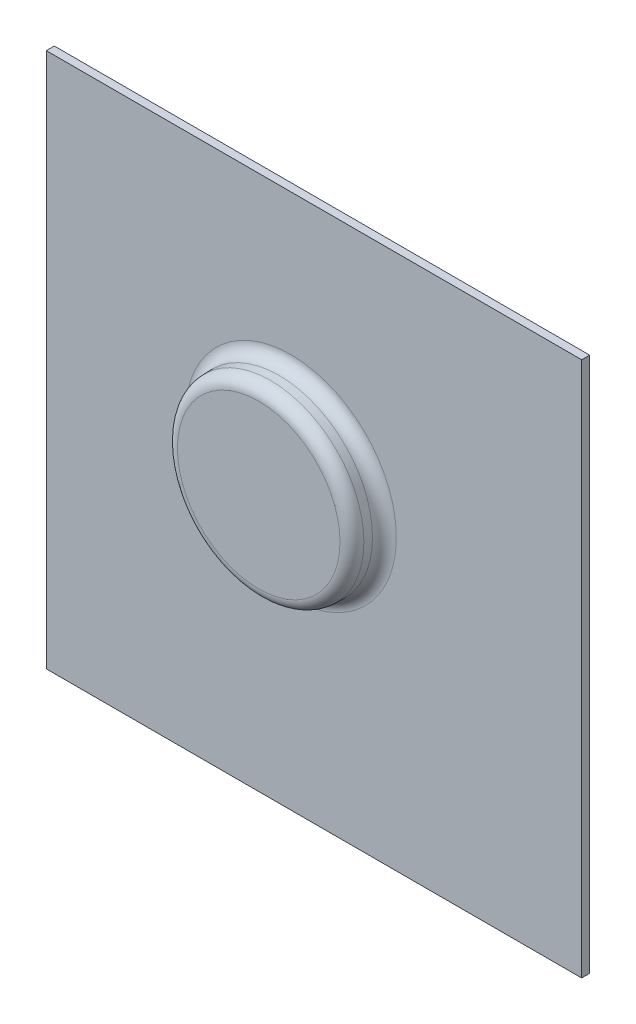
ISO-10303-21;
HEADER;
FILE_DESCRIPTION(('STEP AP214'),'2;1');
FILE_NAME('part.step','',(''),(''),'','','');
FILE_SCHEMA(('AUTOMOTIVE_DESIGN { 1 0 10303 214 1 1 1 1 }'));
ENDSEC;
DATA;
#1=APPLICATION_CONTEXT('core data for automotive mechanical design processes');
#2=APPLICATION_PROTOCOL_DEFINITION('international standard','automotive_design',2000,#1);
#3=PRODUCT_CONTEXT('',#1,'mechanical');
#4=PRODUCT('Part','Part','',(#3));
#5=PRODUCT_RELATED_PRODUCT_CATEGORY('part','',(#4));
#6=PRODUCT_DEFINITION_FORMATION('','',#4);
#7=PRODUCT_DEFINITION_CONTEXT('part definition',#1,'design');
#8=PRODUCT_DEFINITION('design','',#6,#7);
#9=PRODUCT_DEFINITION_SHAPE('','',#8);
#10=(LENGTH_UNIT() NAMED_UNIT(*) SI_UNIT(.MILLI.,.METRE.));
#11=(NAMED_UNIT(*) PLANE_ANGLE_UNIT() SI_UNIT($,.RADIAN.));
#12=(NAMED_UNIT(*) SI_UNIT($,.STERADIAN.) SOLID_ANGLE_UNIT());
#13=UNCERTAINTY_MEASURE_WITH_UNIT(LENGTH_MEASURE(1.E-05),#10,'distance_accuracy_value','');
#14=(GEOMETRIC_REPRESENTATION_CONTEXT(3) GLOBAL_UNCERTAINTY_ASSIGNED_CONTEXT((#13)) GLOBAL_UNIT_ASSIGNED_CONTEXT((#10,
#11,#12)) REPRESENTATION_CONTEXT('',''));
#15=CARTESIAN_POINT('',(0.,0.,0.));
#16=DIRECTION('',(0.,0.,1.));
#17=DIRECTION('',(1.,0.,0.));
#18=AXIS2_PLACEMENT_3D('',#15,#16,#17);
#19=CARTESIAN_POINT('',(0.,100.,0.));
#20=DIRECTION('',(0.,0.,-1.));
#21=DIRECTION('',(-1.,0.,0.));
#22=AXIS2_PLACEMENT_3D('',#19,#20,#21);
#23=PLANE('',#22);
#24=DIRECTION('',(0.,-1.,0.));
#25=VECTOR('',#24,1.);
#26=CARTESIAN_POINT('',(0.,0.,0.));
#27=LINE('',#26,#25);
#28=CARTESIAN_POINT('',(0.,100.,0.));
#29=VERTEX_POINT('',#28);
#30=CARTESIAN_POINT('',(0.,0.,0.));
#31=VERTEX_POINT('',#30);
#32=EDGE_CURVE('E162',#29,#31,#27,.T.);
#33=ORIENTED_EDGE('',*,*,#32,.F.);
#34=DIRECTION('',(-1.,0.,0.));
#35=VECTOR('',#34,1.);
#36=CARTESIAN_POINT('',(0.,100.,0.));
#37=LINE('',#36,#35);
#38=CARTESIAN_POINT('',(100.,100.,0.));
#39=VERTEX_POINT('',#38);
#40=EDGE_CURVE('E78',#39,#29,#37,.T.);
#41=ORIENTED_EDGE('',*,*,#40,.F.);
#42=DIRECTION('',(0.,1.,0.));
#43=VECTOR('',#42,1.);
#44=CARTESIAN_POINT('',(100.,0.,0.));
#45=LINE('',#44,#43);
#46=CARTESIAN_POINT('',(100.,0.,0.));
#47=VERTEX_POINT('',#46);
#48=EDGE_CURVE('E167',#47,#39,#45,.T.);
#49=ORIENTED_EDGE('',*,*,#48,.F.);
#50=DIRECTION('',(1.,0.,0.));
#51=VECTOR('',#50,1.);
#52=CARTESIAN_POINT('',(0.,0.,0.));
#53=LINE('',#52,#51);
#54=EDGE_CURVE('E165',#31,#47,#53,.T.);
#55=ORIENTED_EDGE('',*,*,#54,.F.);
#56=EDGE_LOOP('',(#33,#41,#49,#55));
#57=FACE_BOUND('',#56,.T.);
#58=DIRECTION('',(-1.,0.,0.));
#59=VECTOR('',#58,1.);
#60=CARTESIAN_POINT('',(0.,99.,0.));
#61=LINE('',#60,#59);
#62=CARTESIAN_POINT('',(99.,99.,0.));
#63=VERTEX_POINT('',#62);
#64=CARTESIAN_POINT('',(1.,99.,0.));
#65=VERTEX_POINT('',#64);
#66=EDGE_CURVE('E150',#63,#65,#61,.T.);
#67=ORIENTED_EDGE('',*,*,#66,.T.);
#68=DIRECTION('',(0.,-1.,0.));
#69=VECTOR('',#68,1.);
#70=CARTESIAN_POINT('',(1.,100.,0.));
#71=LINE('',#70,#69);
#72=CARTESIAN_POINT('',(1.,1.,0.));
#73=VERTEX_POINT('',#72);
#74=EDGE_CURVE('E146',#65,#73,#71,.T.);
#75=ORIENTED_EDGE('',*,*,#74,.T.);
#76=DIRECTION('',(1.,0.,0.));
#77=VECTOR('',#76,1.);
#78=CARTESIAN_POINT('',(0.,1.,0.));
#79=LINE('',#78,#77);
#80=CARTESIAN_POINT('',(99.,1.,0.));
#81=VERTEX_POINT('',#80);
#82=EDGE_CURVE('E149',#73,#81,#79,.T.);
#83=ORIENTED_EDGE('',*,*,#82,.T.);
#84=DIRECTION('',(0.,1.,0.));
#85=VECTOR('',#84,1.);
#86=CARTESIAN_POINT('',(99.,100.,0.));
#87=LINE('',#86,#85);
#88=EDGE_CURVE('E48',#81,#63,#87,.T.);
#89=ORIENTED_EDGE('',*,*,#88,.T.);
#90=EDGE_LOOP('',(#67,#75,#83,#89));
#91=FACE_BOUND('',#90,.T.);
#92=ADVANCED_FACE('F33',(#57,#91),#23,.T.);
#93=CARTESIAN_POINT('',(0.,100.,1.5));
#94=DIRECTION('',(0.,0.,-1.));
#95=DIRECTION('',(-1.,0.,0.));
#96=AXIS2_PLACEMENT_3D('',#93,#94,#95);
#97=PLANE('',#96);
#98=CARTESIAN_POINT('',(45.6754604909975,53.96195551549,1.5));
#99=DIRECTION('',(0.,0.,-1.));
#100=DIRECTION('',(-1.,0.,0.));
#101=AXIS2_PLACEMENT_3D('',#98,#99,#100);
#102=CIRCLE('',#101,19.7110688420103);
#103=CARTESIAN_POINT('',(25.9643916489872,53.96195551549,1.5));
#104=VERTEX_POINT('',#103);
#105=EDGE_CURVE('E11',#104,#104,#102,.T.);
#106=ORIENTED_EDGE('',*,*,#105,.T.);
#107=EDGE_LOOP('',(#106));
#108=FACE_BOUND('',#107,.T.);
#109=DIRECTION('',(0.,-1.,0.));
#110=VECTOR('',#109,1.);
#111=CARTESIAN_POINT('',(0.,0.,1.5));
#112=LINE('',#111,#110);
#113=CARTESIAN_POINT('',(0.,100.,1.5));
#114=VERTEX_POINT('',#113);
#115=CARTESIAN_POINT('',(0.,0.,1.5));
#116=VERTEX_POINT('',#115);
#117=EDGE_CURVE('E155',#114,#116,#112,.T.);
#118=ORIENTED_EDGE('',*,*,#117,.T.);
#119=DIRECTION('',(1.,0.,0.));
#120=VECTOR('',#119,1.);
#121=CARTESIAN_POINT('',(0.,0.,1.5));
#122=LINE('',#121,#120);
#123=CARTESIAN_POINT('',(100.,0.,1.5));
#124=VERTEX_POINT('',#123);
#125=EDGE_CURVE('E86',#116,#124,#122,.T.);
#126=ORIENTED_EDGE('',*,*,#125,.T.);
#127=DIRECTION('',(0.,1.,0.));
#128=VECTOR('',#127,1.);
#129=CARTESIAN_POINT('',(100.,0.,1.5));
#130=LINE('',#129,#128);
#131=CARTESIAN_POINT('',(100.,100.,1.5));
#132=VERTEX_POINT('',#131);
#133=EDGE_CURVE('E158',#124,#132,#130,.T.);
#134=ORIENTED_EDGE('',*,*,#133,.T.);
#135=DIRECTION('',(-1.,0.,0.));
#136=VECTOR('',#135,1.);
#137=CARTESIAN_POINT('',(0.,100.,1.5));
#138=LINE('',#137,#136);
#139=EDGE_CURVE('E57',#132,#114,#138,.T.);
#140=ORIENTED_EDGE('',*,*,#139,.T.);
#141=EDGE_LOOP('',(#118,#126,#134,#140));
#142=FACE_BOUND('',#141,.T.);
#143=ADVANCED_FACE('F203',(#108,#142),#97,.F.);
#144=CARTESIAN_POINT('',(0.,0.,1.5));
#145=DIRECTION('',(1.,0.,0.));
#146=DIRECTION('',(0.,0.,-1.));
#147=AXIS2_PLACEMENT_3D('',#144,#145,#146);
#148=PLANE('',#147);
#149=ORIENTED_EDGE('',*,*,#32,.T.);
#150=DIRECTION('',(0.,0.,-1.));
#151=VECTOR('',#150,1.);
#152=CARTESIAN_POINT('',(0.,0.,1.5));
#153=LINE('',#152,#151);
#154=EDGE_CURVE('E176',#116,#31,#153,.T.);
#155=ORIENTED_EDGE('',*,*,#154,.F.);
#156=ORIENTED_EDGE('',*,*,#117,.F.);
#157=DIRECTION('',(0.,0.,-1.));
#158=VECTOR('',#157,1.);
#159=CARTESIAN_POINT('',(0.,100.,1.5));
#160=LINE('',#159,#158);
#161=EDGE_CURVE('E161',#114,#29,#160,.T.);
#162=ORIENTED_EDGE('',*,*,#161,.T.);
#163=EDGE_LOOP('',(#149,#155,#156,#162));
#164=FACE_BOUND('',#163,.T.);
#165=ADVANCED_FACE('F209',(#164),#148,.F.);
#166=CARTESIAN_POINT('',(0.,0.,1.5));
#167=DIRECTION('',(0.,1.,0.));
#168=DIRECTION('',(0.,0.,1.));
#169=AXIS2_PLACEMENT_3D('',#166,#167,#168);
#170=PLANE('',#169);
#171=ORIENTED_EDGE('',*,*,#54,.T.);
#172=DIRECTION('',(0.,0.,-1.));
#173=VECTOR('',#172,1.);
#174=CARTESIAN_POINT('',(100.,0.,1.5));
#175=LINE('',#174,#173);
#176=EDGE_CURVE('E173',#124,#47,#175,.T.);
#177=ORIENTED_EDGE('',*,*,#176,.F.);
#178=ORIENTED_EDGE('',*,*,#125,.F.);
#179=ORIENTED_EDGE('',*,*,#154,.T.);
#180=EDGE_LOOP('',(#171,#177,#178,#179));
#181=FACE_BOUND('',#180,.T.);
#182=ADVANCED_FACE('F222',(#181),#170,.F.);
#183=CARTESIAN_POINT('',(100.,0.,1.5));
#184=DIRECTION('',(-1.,0.,0.));
#185=DIRECTION('',(0.,0.,1.));
#186=AXIS2_PLACEMENT_3D('',#183,#184,#185);
#187=PLANE('',#186);
#188=ORIENTED_EDGE('',*,*,#48,.T.);
#189=DIRECTION('',(0.,0.,-1.));
#190=VECTOR('',#189,1.);
#191=CARTESIAN_POINT('',(100.,100.,1.5));
#192=LINE('',#191,#190);
#193=EDGE_CURVE('E171',#132,#39,#192,.T.);
#194=ORIENTED_EDGE('',*,*,#193,.F.);
#195=ORIENTED_EDGE('',*,*,#133,.F.);
#196=ORIENTED_EDGE('',*,*,#176,.T.);
#197=EDGE_LOOP('',(#188,#194,#195,#196));
#198=FACE_BOUND('',#197,.T.);
#199=ADVANCED_FACE('F219',(#198),#187,.F.);
#200=CARTESIAN_POINT('',(0.,100.,1.5));
#201=DIRECTION('',(0.,-1.,0.));
#202=DIRECTION('',(0.,0.,-1.));
#203=AXIS2_PLACEMENT_3D('',#200,#201,#202);
#204=PLANE('',#203);
#205=ORIENTED_EDGE('',*,*,#40,.T.);
#206=ORIENTED_EDGE('',*,*,#161,.F.);
#207=ORIENTED_EDGE('',*,*,#139,.F.);
#208=ORIENTED_EDGE('',*,*,#193,.T.);
#209=EDGE_LOOP('',(#205,#206,#207,#208));
#210=FACE_BOUND('',#209,.T.);
#211=ADVANCED_FACE('F216',(#210),#204,.F.);
#212=CARTESIAN_POINT('',(45.6754604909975,53.96195551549,1.5));
#213=DIRECTION('',(0.,0.,-1.));
#214=DIRECTION('',(1.,0.,0.));
#215=AXIS2_PLACEMENT_3D('',#212,#213,#214);
#216=CONICAL_SURFACE('',#215,17.5,0.0174532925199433);
#217=CARTESIAN_POINT('',(45.6754604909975,53.96195551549,3.71073208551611));
#218=DIRECTION('',(0.,0.,-1.));
#219=DIRECTION('',(-1.,0.,0.));
#220=AXIS2_PLACEMENT_3D('',#217,#218,#219);
#221=CIRCLE('',#220,17.4614115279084);
#222=CARTESIAN_POINT('',(28.214048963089,53.96195551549,3.71073208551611));
#223=VERTEX_POINT('',#222);
#224=EDGE_CURVE('E41',#223,#223,#221,.F.);
#225=ORIENTED_EDGE('',*,*,#224,.T.);
#226=EDGE_LOOP('',(#225));
#227=FACE_BOUND('',#226,.T.);
#228=CARTESIAN_POINT('',(45.6754604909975,53.96195551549,5.28926791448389));
#229=DIRECTION('',(0.,0.,-1.));
#230=DIRECTION('',(-1.,0.,0.));
#231=AXIS2_PLACEMENT_3D('',#228,#229,#230);
#232=CIRCLE('',#231,17.4338580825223);
#233=CARTESIAN_POINT('',(28.2416024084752,53.96195551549,5.28926791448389));
#234=VERTEX_POINT('',#233);
#235=EDGE_CURVE('E181',#234,#234,#232,.T.);
#236=ORIENTED_EDGE('',*,*,#235,.T.);
#237=EDGE_LOOP('',(#236));
#238=FACE_BOUND('',#237,.T.);
#239=ADVANCED_FACE('F186',(#227,#238),#216,.T.);
#240=CARTESIAN_POINT('',(45.6754604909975,53.96195551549,7.5));
#241=DIRECTION('',(0.,0.,1.));
#242=DIRECTION('',(1.,0.,0.));
#243=AXIS2_PLACEMENT_3D('',#240,#241,#242);
#244=PLANE('',#243);
#245=CARTESIAN_POINT('',(45.6754604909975,53.96195551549,7.5));
#246=DIRECTION('',(0.,0.,1.));
#247=DIRECTION('',(1.,0.,0.));
#248=AXIS2_PLACEMENT_3D('',#245,#246,#247);
#249=CIRCLE('',#248,15.1842007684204);
#250=CARTESIAN_POINT('',(60.8596612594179,53.96195551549,7.5));
#251=VERTEX_POINT('',#250);
#252=EDGE_CURVE('E178',#251,#251,#249,.T.);
#253=ORIENTED_EDGE('',*,*,#252,.T.);
#254=EDGE_LOOP('',(#253));
#255=FACE_BOUND('',#254,.T.);
#256=ADVANCED_FACE('F199',(#255),#244,.T.);
#257=CARTESIAN_POINT('',(45.6754604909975,53.96195551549,5.25));
#258=DIRECTION('',(0.,0.,1.));
#259=DIRECTION('',(1.,0.,0.));
#260=AXIS2_PLACEMENT_3D('',#257,#258,#259);
#261=TOROIDAL_SURFACE('',#260,15.1842007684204,2.25);
#262=ORIENTED_EDGE('',*,*,#235,.F.);
#263=EDGE_LOOP('',(#262));
#264=FACE_BOUND('',#263,.T.);
#265=ORIENTED_EDGE('',*,*,#252,.F.);
#266=EDGE_LOOP('',(#265));
#267=FACE_BOUND('',#266,.T.);
#268=ADVANCED_FACE('F190',(#264,#267),#261,.T.);
#269=CARTESIAN_POINT('',(45.6754604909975,53.96195551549,3.75));
#270=DIRECTION('',(0.,0.,-1.));
#271=DIRECTION('',(-1.,0.,0.));
#272=AXIS2_PLACEMENT_3D('',#269,#270,#271);
#273=TOROIDAL_SURFACE('',#272,19.7110688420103,2.25);
#274=ORIENTED_EDGE('',*,*,#105,.F.);
#275=EDGE_LOOP('',(#274));
#276=FACE_BOUND('',#275,.T.);
#277=ORIENTED_EDGE('',*,*,#224,.F.);
#278=EDGE_LOOP('',(#277));
#279=FACE_BOUND('',#278,.T.);
#280=ADVANCED_FACE('F35',(#276,#279),#273,.F.);
#281=CARTESIAN_POINT('',(0.,100.,0.5));
#282=DIRECTION('',(0.,0.,-1.));
#283=DIRECTION('',(-1.,0.,0.));
#284=AXIS2_PLACEMENT_3D('',#281,#282,#283);
#285=PLANE('',#284);
#286=CARTESIAN_POINT('',(45.6754604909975,53.96195551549,0.5));
#287=DIRECTION('',(0.,0.,-1.));
#288=DIRECTION('',(-1.,0.,0.));
#289=AXIS2_PLACEMENT_3D('',#286,#287,#288);
#290=CIRCLE('',#289,19.7110688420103);
#291=CARTESIAN_POINT('',(25.9643916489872,53.96195551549,0.5));
#292=VERTEX_POINT('',#291);
#293=EDGE_CURVE('E140',#292,#292,#290,.T.);
#294=ORIENTED_EDGE('',*,*,#293,.F.);
#295=EDGE_LOOP('',(#294));
#296=FACE_BOUND('',#295,.T.);
#297=DIRECTION('',(0.,-1.,0.));
#298=VECTOR('',#297,1.);
#299=CARTESIAN_POINT('',(1.,100.,0.5));
#300=LINE('',#299,#298);
#301=CARTESIAN_POINT('',(1.,99.,0.5));
#302=VERTEX_POINT('',#301);
#303=CARTESIAN_POINT('',(1.,1.,0.5));
#304=VERTEX_POINT('',#303);
#305=EDGE_CURVE('E119',#302,#304,#300,.T.);
#306=ORIENTED_EDGE('',*,*,#305,.F.);
#307=DIRECTION('',(-1.,0.,0.));
#308=VECTOR('',#307,1.);
#309=CARTESIAN_POINT('',(0.,99.,0.5));
#310=LINE('',#309,#308);
#311=CARTESIAN_POINT('',(99.,99.,0.5));
#312=VERTEX_POINT('',#311);
#313=EDGE_CURVE('E127',#312,#302,#310,.T.);
#314=ORIENTED_EDGE('',*,*,#313,.F.);
#315=DIRECTION('',(0.,1.,0.));
#316=VECTOR('',#315,1.);
#317=CARTESIAN_POINT('',(99.,100.,0.5));
#318=LINE('',#317,#316);
#319=CARTESIAN_POINT('',(99.,1.,0.5));
#320=VERTEX_POINT('',#319);
#321=EDGE_CURVE('E118',#320,#312,#318,.T.);
#322=ORIENTED_EDGE('',*,*,#321,.F.);
#323=DIRECTION('',(1.,0.,0.));
#324=VECTOR('',#323,1.);
#325=CARTESIAN_POINT('',(0.,1.,0.5));
#326=LINE('',#325,#324);
#327=EDGE_CURVE('E108',#304,#320,#326,.T.);
#328=ORIENTED_EDGE('',*,*,#327,.F.);
#329=EDGE_LOOP('',(#306,#314,#322,#328));
#330=FACE_BOUND('',#329,.T.);
#331=ADVANCED_FACE('F126',(#296,#330),#285,.T.);
#332=CARTESIAN_POINT('',(1.,0.,1.5));
#333=DIRECTION('',(1.,0.,0.));
#334=DIRECTION('',(0.,0.,-1.));
#335=AXIS2_PLACEMENT_3D('',#332,#333,#334);
#336=PLANE('',#335);
#337=ORIENTED_EDGE('',*,*,#74,.F.);
#338=DIRECTION('',(0.,0.,-1.));
#339=VECTOR('',#338,1.);
#340=CARTESIAN_POINT('',(1.,99.,1.5));
#341=LINE('',#340,#339);
#342=EDGE_CURVE('E129',#302,#65,#341,.T.);
#343=ORIENTED_EDGE('',*,*,#342,.F.);
#344=ORIENTED_EDGE('',*,*,#305,.T.);
#345=DIRECTION('',(0.,0.,-1.));
#346=VECTOR('',#345,1.);
#347=CARTESIAN_POINT('',(1.,1.,1.5));
#348=LINE('',#347,#346);
#349=EDGE_CURVE('E113',#304,#73,#348,.T.);
#350=ORIENTED_EDGE('',*,*,#349,.T.);
#351=EDGE_LOOP('',(#337,#343,#344,#350));
#352=FACE_BOUND('',#351,.T.);
#353=ADVANCED_FACE('F196',(#352),#336,.T.);
#354=CARTESIAN_POINT('',(0.,1.,1.5));
#355=DIRECTION('',(0.,1.,0.));
#356=DIRECTION('',(0.,0.,1.));
#357=AXIS2_PLACEMENT_3D('',#354,#355,#356);
#358=PLANE('',#357);
#359=ORIENTED_EDGE('',*,*,#82,.F.);
#360=ORIENTED_EDGE('',*,*,#349,.F.);
#361=ORIENTED_EDGE('',*,*,#327,.T.);
#362=DIRECTION('',(0.,0.,-1.));
#363=VECTOR('',#362,1.);
#364=CARTESIAN_POINT('',(99.,1.,1.5));
#365=LINE('',#364,#363);
#366=EDGE_CURVE('E110',#320,#81,#365,.T.);
#367=ORIENTED_EDGE('',*,*,#366,.T.);
#368=EDGE_LOOP('',(#359,#360,#361,#367));
#369=FACE_BOUND('',#368,.T.);
#370=ADVANCED_FACE('F109',(#369),#358,.T.);
#371=CARTESIAN_POINT('',(99.,0.,1.5));
#372=DIRECTION('',(-1.,0.,0.));
#373=DIRECTION('',(0.,0.,1.));
#374=AXIS2_PLACEMENT_3D('',#371,#372,#373);
#375=PLANE('',#374);
#376=ORIENTED_EDGE('',*,*,#88,.F.);
#377=ORIENTED_EDGE('',*,*,#366,.F.);
#378=ORIENTED_EDGE('',*,*,#321,.T.);
#379=DIRECTION('',(0.,0.,-1.));
#380=VECTOR('',#379,1.);
#381=CARTESIAN_POINT('',(99.,99.,1.5));
#382=LINE('',#381,#380);
#383=EDGE_CURVE('E123',#312,#63,#382,.T.);
#384=ORIENTED_EDGE('',*,*,#383,.T.);
#385=EDGE_LOOP('',(#376,#377,#378,#384));
#386=FACE_BOUND('',#385,.T.);
#387=ADVANCED_FACE('F121',(#386),#375,.T.);
#388=CARTESIAN_POINT('',(0.,99.,1.5));
#389=DIRECTION('',(0.,-1.,0.));
#390=DIRECTION('',(0.,0.,-1.));
#391=AXIS2_PLACEMENT_3D('',#388,#389,#390);
#392=PLANE('',#391);
#393=ORIENTED_EDGE('',*,*,#66,.F.);
#394=ORIENTED_EDGE('',*,*,#383,.F.);
#395=ORIENTED_EDGE('',*,*,#313,.T.);
#396=ORIENTED_EDGE('',*,*,#342,.T.);
#397=EDGE_LOOP('',(#393,#394,#395,#396));
#398=FACE_BOUND('',#397,.T.);
#399=ADVANCED_FACE('F313',(#398),#392,.T.);
#400=CARTESIAN_POINT('',(45.6754604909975,53.96195551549,1.48254759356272));
#401=DIRECTION('',(0.,0.,-1.));
#402=DIRECTION('',(1.,0.,0.));
#403=AXIS2_PLACEMENT_3D('',#400,#401,#402);
#404=CONICAL_SURFACE('',#403,16.5001523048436,0.0174532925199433);
#405=CARTESIAN_POINT('',(45.6754604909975,53.96195551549,3.69327967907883));
#406=DIRECTION('',(0.,0.,-1.));
#407=DIRECTION('',(-1.,0.,0.));
#408=AXIS2_PLACEMENT_3D('',#405,#406,#407);
#409=CIRCLE('',#408,16.461563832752);
#410=CARTESIAN_POINT('',(29.2138966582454,53.96195551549,3.69327967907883));
#411=VERTEX_POINT('',#410);
#412=EDGE_CURVE('E137',#411,#411,#409,.F.);
#413=ORIENTED_EDGE('',*,*,#412,.F.);
#414=EDGE_LOOP('',(#413));
#415=FACE_BOUND('',#414,.T.);
#416=CARTESIAN_POINT('',(45.6754604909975,53.96195551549,5.2718155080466));
#417=DIRECTION('',(0.,0.,-1.));
#418=DIRECTION('',(-1.,0.,0.));
#419=AXIS2_PLACEMENT_3D('',#416,#417,#418);
#420=CIRCLE('',#419,16.4340103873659);
#421=CARTESIAN_POINT('',(29.2414501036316,53.96195551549,5.2718155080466));
#422=VERTEX_POINT('',#421);
#423=EDGE_CURVE('E141',#422,#422,#420,.T.);
#424=ORIENTED_EDGE('',*,*,#423,.F.);
#425=EDGE_LOOP('',(#424));
#426=FACE_BOUND('',#425,.T.);
#427=ADVANCED_FACE('F321',(#415,#426),#404,.F.);
#428=CARTESIAN_POINT('',(45.6754604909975,53.96195551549,6.5));
#429=DIRECTION('',(0.,0.,1.));
#430=DIRECTION('',(1.,0.,0.));
#431=AXIS2_PLACEMENT_3D('',#428,#429,#430);
#432=PLANE('',#431);
#433=CARTESIAN_POINT('',(45.6754604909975,53.96195551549,6.5));
#434=DIRECTION('',(0.,0.,1.));
#435=DIRECTION('',(1.,0.,0.));
#436=AXIS2_PLACEMENT_3D('',#433,#434,#435);
#437=CIRCLE('',#436,15.1842007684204);
#438=CARTESIAN_POINT('',(60.8596612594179,53.96195551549,6.5));
#439=VERTEX_POINT('',#438);
#440=EDGE_CURVE('E134',#439,#439,#437,.T.);
#441=ORIENTED_EDGE('',*,*,#440,.F.);
#442=EDGE_LOOP('',(#441));
#443=FACE_BOUND('',#442,.T.);
#444=ADVANCED_FACE('F334',(#443),#432,.F.);
#445=CARTESIAN_POINT('',(45.6754604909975,53.96195551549,5.25));
#446=DIRECTION('',(0.,0.,1.));
#447=DIRECTION('',(1.,0.,0.));
#448=AXIS2_PLACEMENT_3D('',#445,#446,#447);
#449=TOROIDAL_SURFACE('',#448,15.1842007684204,1.25);
#450=ORIENTED_EDGE('',*,*,#423,.T.);
#451=EDGE_LOOP('',(#450));
#452=FACE_BOUND('',#451,.T.);
#453=ORIENTED_EDGE('',*,*,#440,.T.);
#454=EDGE_LOOP('',(#453));
#455=FACE_BOUND('',#454,.T.);
#456=ADVANCED_FACE('F343',(#452,#455),#449,.F.);
#457=CARTESIAN_POINT('',(45.6754604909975,53.96195551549,3.75));
#458=DIRECTION('',(0.,0.,-1.));
#459=DIRECTION('',(-1.,0.,0.));
#460=AXIS2_PLACEMENT_3D('',#457,#458,#459);
#461=TOROIDAL_SURFACE('',#460,19.7110688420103,3.25);
#462=ORIENTED_EDGE('',*,*,#293,.T.);
#463=EDGE_LOOP('',(#462));
#464=FACE_BOUND('',#463,.T.);
#465=ORIENTED_EDGE('',*,*,#412,.T.);
#466=EDGE_LOOP('',(#465));
#467=FACE_BOUND('',#466,.T.);
#468=ADVANCED_FACE('F352',(#464,#467),#461,.T.);
#469=CLOSED_SHELL('',(#92,#143,#165,#182,#199,#211,#239,#256,#268,#280,#331,#353,#370,#387,#399,
#427,#444,#456,#468));
#470=MANIFOLD_SOLID_BREP('B2',#469);
#471=ADVANCED_BREP_SHAPE_REPRESENTATION('',(#18,#470),#14);
#472=SHAPE_DEFINITION_REPRESENTATION(#9,#471);
ENDSEC;
END-ISO-10303-21;
